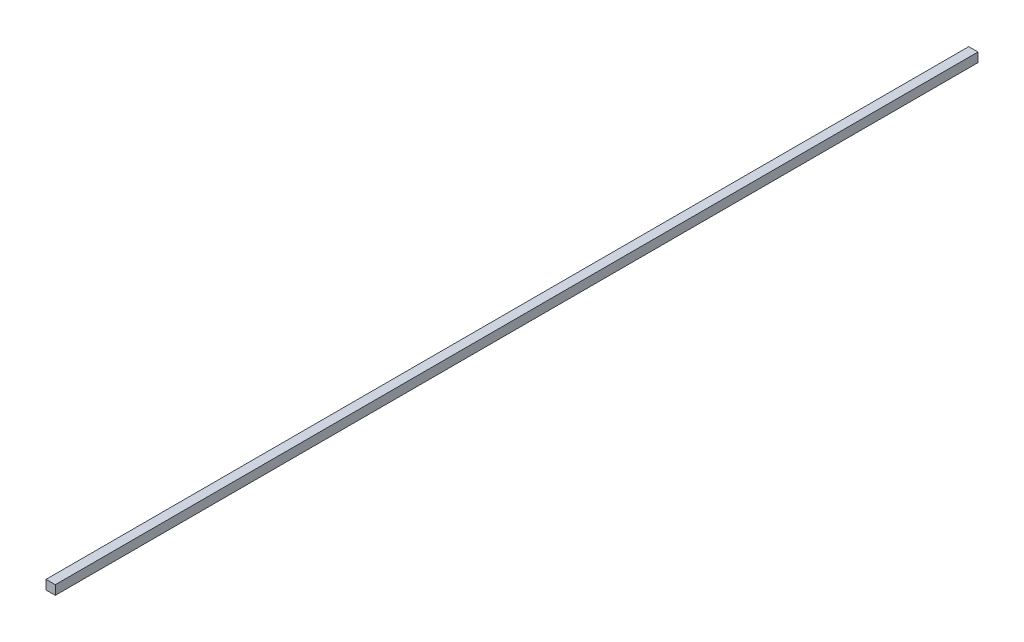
ISO-10303-21;
HEADER;
FILE_DESCRIPTION(('STEP AP214'),'2;1');
FILE_NAME('part.step','',(''),(''),'','','');
FILE_SCHEMA(('AUTOMOTIVE_DESIGN { 1 0 10303 214 1 1 1 1 }'));
ENDSEC;
DATA;
#1=APPLICATION_CONTEXT('core data for automotive mechanical design processes');
#2=APPLICATION_PROTOCOL_DEFINITION('international standard','automotive_design',2000,#1);
#3=PRODUCT_CONTEXT('',#1,'mechanical');
#4=PRODUCT('Part','Part','',(#3));
#5=PRODUCT_RELATED_PRODUCT_CATEGORY('part','',(#4));
#6=PRODUCT_DEFINITION_FORMATION('','',#4);
#7=PRODUCT_DEFINITION_CONTEXT('part definition',#1,'design');
#8=PRODUCT_DEFINITION('design','',#6,#7);
#9=PRODUCT_DEFINITION_SHAPE('','',#8);
#10=(LENGTH_UNIT() NAMED_UNIT(*) SI_UNIT(.MILLI.,.METRE.));
#11=(NAMED_UNIT(*) PLANE_ANGLE_UNIT() SI_UNIT($,.RADIAN.));
#12=(NAMED_UNIT(*) SI_UNIT($,.STERADIAN.) SOLID_ANGLE_UNIT());
#13=UNCERTAINTY_MEASURE_WITH_UNIT(LENGTH_MEASURE(1.E-05),#10,'distance_accuracy_value','');
#14=(GEOMETRIC_REPRESENTATION_CONTEXT(3) GLOBAL_UNCERTAINTY_ASSIGNED_CONTEXT((#13)) GLOBAL_UNIT_ASSIGNED_CONTEXT((#10,
#11,#12)) REPRESENTATION_CONTEXT('',''));
#15=CARTESIAN_POINT('',(0.,0.,0.));
#16=DIRECTION('',(0.,0.,1.));
#17=DIRECTION('',(1.,0.,0.));
#18=AXIS2_PLACEMENT_3D('',#15,#16,#17);
#19=CARTESIAN_POINT('',(0.,0.,474.389));
#20=DIRECTION('',(0.,1.,0.));
#21=DIRECTION('',(-1.,0.,0.));
#22=AXIS2_PLACEMENT_3D('',#19,#20,#21);
#23=PLANE('',#22);
#24=DIRECTION('',(1.,0.,0.));
#25=VECTOR('',#24,1.);
#26=CARTESIAN_POINT('',(0.,0.,0.));
#27=LINE('',#26,#25);
#28=CARTESIAN_POINT('',(0.,0.,0.));
#29=VERTEX_POINT('',#28);
#30=CARTESIAN_POINT('',(4.7625,0.,0.));
#31=VERTEX_POINT('',#30);
#32=EDGE_CURVE('E95',#29,#31,#27,.T.);
#33=ORIENTED_EDGE('',*,*,#32,.T.);
#34=DIRECTION('',(0.,0.,-1.));
#35=VECTOR('',#34,1.);
#36=CARTESIAN_POINT('',(4.7625,0.,474.389));
#37=LINE('',#36,#35);
#38=CARTESIAN_POINT('',(4.7625,0.,474.389));
#39=VERTEX_POINT('',#38);
#40=EDGE_CURVE('E11',#39,#31,#37,.T.);
#41=ORIENTED_EDGE('',*,*,#40,.F.);
#42=DIRECTION('',(1.,0.,0.));
#43=VECTOR('',#42,1.);
#44=CARTESIAN_POINT('',(0.,0.,474.389));
#45=LINE('',#44,#43);
#46=CARTESIAN_POINT('',(0.,0.,474.389));
#47=VERTEX_POINT('',#46);
#48=EDGE_CURVE('E83',#47,#39,#45,.T.);
#49=ORIENTED_EDGE('',*,*,#48,.F.);
#50=DIRECTION('',(0.,0.,-1.));
#51=VECTOR('',#50,1.);
#52=CARTESIAN_POINT('',(0.,0.,474.389));
#53=LINE('',#52,#51);
#54=EDGE_CURVE('E91',#47,#29,#53,.T.);
#55=ORIENTED_EDGE('',*,*,#54,.T.);
#56=EDGE_LOOP('',(#33,#41,#49,#55));
#57=FACE_BOUND('',#56,.T.);
#58=ADVANCED_FACE('F32',(#57),#23,.F.);
#59=CARTESIAN_POINT('',(4.7625,0.,474.389));
#60=DIRECTION('',(-1.,0.,0.));
#61=DIRECTION('',(0.,0.,1.));
#62=AXIS2_PLACEMENT_3D('',#59,#60,#61);
#63=PLANE('',#62);
#64=DIRECTION('',(0.,1.,0.));
#65=VECTOR('',#64,1.);
#66=CARTESIAN_POINT('',(4.7625,0.,0.));
#67=LINE('',#66,#65);
#68=CARTESIAN_POINT('',(4.7625,4.7625,0.));
#69=VERTEX_POINT('',#68);
#70=EDGE_CURVE('E87',#31,#69,#67,.T.);
#71=ORIENTED_EDGE('',*,*,#70,.T.);
#72=DIRECTION('',(0.,0.,-1.));
#73=VECTOR('',#72,1.);
#74=CARTESIAN_POINT('',(4.7625,4.7625,474.389));
#75=LINE('',#74,#73);
#76=CARTESIAN_POINT('',(4.7625,4.7625,474.389));
#77=VERTEX_POINT('',#76);
#78=EDGE_CURVE('E40',#77,#69,#75,.T.);
#79=ORIENTED_EDGE('',*,*,#78,.F.);
#80=DIRECTION('',(0.,1.,0.));
#81=VECTOR('',#80,1.);
#82=CARTESIAN_POINT('',(4.7625,0.,474.389));
#83=LINE('',#82,#81);
#84=EDGE_CURVE('E78',#39,#77,#83,.T.);
#85=ORIENTED_EDGE('',*,*,#84,.F.);
#86=ORIENTED_EDGE('',*,*,#40,.T.);
#87=EDGE_LOOP('',(#71,#79,#85,#86));
#88=FACE_BOUND('',#87,.T.);
#89=ADVANCED_FACE('F86',(#88),#63,.F.);
#90=CARTESIAN_POINT('',(0.,4.7625,474.389));
#91=DIRECTION('',(0.,-1.,0.));
#92=DIRECTION('',(0.,0.,-1.));
#93=AXIS2_PLACEMENT_3D('',#90,#91,#92);
#94=PLANE('',#93);
#95=DIRECTION('',(-1.,0.,0.));
#96=VECTOR('',#95,1.);
#97=CARTESIAN_POINT('',(0.,4.7625,0.));
#98=LINE('',#97,#96);
#99=CARTESIAN_POINT('',(0.,4.7625,0.));
#100=VERTEX_POINT('',#99);
#101=EDGE_CURVE('E65',#69,#100,#98,.T.);
#102=ORIENTED_EDGE('',*,*,#101,.T.);
#103=DIRECTION('',(0.,0.,-1.));
#104=VECTOR('',#103,1.);
#105=CARTESIAN_POINT('',(0.,4.7625,474.389));
#106=LINE('',#105,#104);
#107=CARTESIAN_POINT('',(0.,4.7625,474.389));
#108=VERTEX_POINT('',#107);
#109=EDGE_CURVE('E88',#108,#100,#106,.T.);
#110=ORIENTED_EDGE('',*,*,#109,.F.);
#111=DIRECTION('',(-1.,0.,0.));
#112=VECTOR('',#111,1.);
#113=CARTESIAN_POINT('',(0.,4.7625,474.389));
#114=LINE('',#113,#112);
#115=EDGE_CURVE('E81',#77,#108,#114,.T.);
#116=ORIENTED_EDGE('',*,*,#115,.F.);
#117=ORIENTED_EDGE('',*,*,#78,.T.);
#118=EDGE_LOOP('',(#102,#110,#116,#117));
#119=FACE_BOUND('',#118,.T.);
#120=ADVANCED_FACE('F89',(#119),#94,.F.);
#121=CARTESIAN_POINT('',(0.,0.,474.389));
#122=DIRECTION('',(1.,0.,0.));
#123=DIRECTION('',(0.,1.,0.));
#124=AXIS2_PLACEMENT_3D('',#121,#122,#123);
#125=PLANE('',#124);
#126=DIRECTION('',(0.,-1.,0.));
#127=VECTOR('',#126,1.);
#128=CARTESIAN_POINT('',(0.,0.,0.));
#129=LINE('',#128,#127);
#130=EDGE_CURVE('E71',#100,#29,#129,.T.);
#131=ORIENTED_EDGE('',*,*,#130,.T.);
#132=ORIENTED_EDGE('',*,*,#54,.F.);
#133=DIRECTION('',(0.,-1.,0.));
#134=VECTOR('',#133,1.);
#135=CARTESIAN_POINT('',(0.,0.,474.389));
#136=LINE('',#135,#134);
#137=EDGE_CURVE('E48',#108,#47,#136,.T.);
#138=ORIENTED_EDGE('',*,*,#137,.F.);
#139=ORIENTED_EDGE('',*,*,#109,.T.);
#140=EDGE_LOOP('',(#131,#132,#138,#139));
#141=FACE_BOUND('',#140,.T.);
#142=ADVANCED_FACE('F102',(#141),#125,.F.);
#143=CARTESIAN_POINT('',(0.,0.,474.389));
#144=DIRECTION('',(0.,0.,1.));
#145=DIRECTION('',(1.,0.,0.));
#146=AXIS2_PLACEMENT_3D('',#143,#144,#145);
#147=PLANE('',#146);
#148=ORIENTED_EDGE('',*,*,#48,.T.);
#149=ORIENTED_EDGE('',*,*,#84,.T.);
#150=ORIENTED_EDGE('',*,*,#115,.T.);
#151=ORIENTED_EDGE('',*,*,#137,.T.);
#152=EDGE_LOOP('',(#148,#149,#150,#151));
#153=FACE_BOUND('',#152,.T.);
#154=ADVANCED_FACE('F79',(#153),#147,.T.);
#155=CARTESIAN_POINT('',(0.,0.,0.));
#156=DIRECTION('',(0.,0.,1.));
#157=DIRECTION('',(1.,0.,0.));
#158=AXIS2_PLACEMENT_3D('',#155,#156,#157);
#159=PLANE('',#158);
#160=ORIENTED_EDGE('',*,*,#32,.F.);
#161=ORIENTED_EDGE('',*,*,#130,.F.);
#162=ORIENTED_EDGE('',*,*,#101,.F.);
#163=ORIENTED_EDGE('',*,*,#70,.F.);
#164=EDGE_LOOP('',(#160,#161,#162,#163));
#165=FACE_BOUND('',#164,.T.);
#166=ADVANCED_FACE('F105',(#165),#159,.F.);
#167=CLOSED_SHELL('',(#58,#89,#120,#142,#154,#166));
#168=MANIFOLD_SOLID_BREP('B2',#167);
#169=ADVANCED_BREP_SHAPE_REPRESENTATION('',(#18,#168),#14);
#170=SHAPE_DEFINITION_REPRESENTATION(#9,#169);
ENDSEC;
END-ISO-10303-21;
